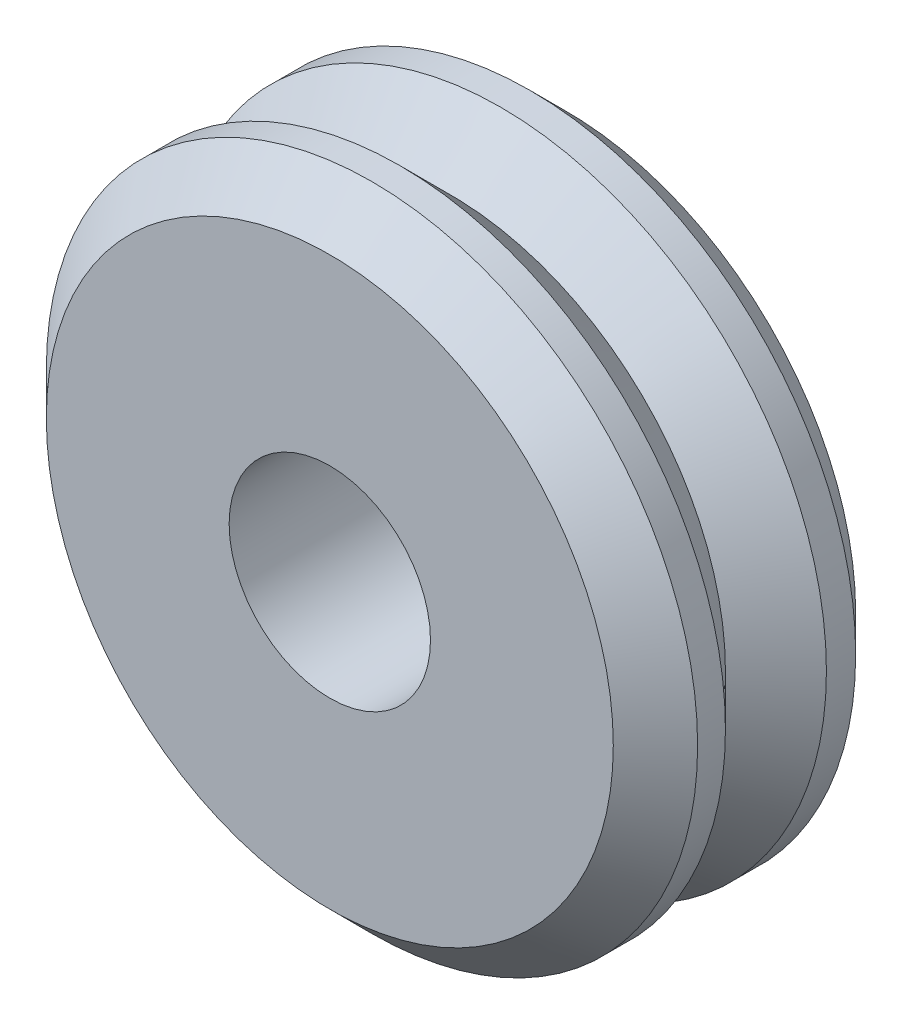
ISO-10303-21;
HEADER;
FILE_DESCRIPTION(('STEP AP214'),'2;1');
FILE_NAME('part.step','',(''),(''),'','','');
FILE_SCHEMA(('AUTOMOTIVE_DESIGN { 1 0 10303 214 1 1 1 1 }'));
ENDSEC;
DATA;
#1=APPLICATION_CONTEXT('core data for automotive mechanical design processes');
#2=APPLICATION_PROTOCOL_DEFINITION('international standard','automotive_design',2000,#1);
#3=PRODUCT_CONTEXT('',#1,'mechanical');
#4=PRODUCT('Part','Part','',(#3));
#5=PRODUCT_RELATED_PRODUCT_CATEGORY('part','',(#4));
#6=PRODUCT_DEFINITION_FORMATION('','',#4);
#7=PRODUCT_DEFINITION_CONTEXT('part definition',#1,'design');
#8=PRODUCT_DEFINITION('design','',#6,#7);
#9=PRODUCT_DEFINITION_SHAPE('','',#8);
#10=(LENGTH_UNIT() NAMED_UNIT(*) SI_UNIT(.MILLI.,.METRE.));
#11=(NAMED_UNIT(*) PLANE_ANGLE_UNIT() SI_UNIT($,.RADIAN.));
#12=(NAMED_UNIT(*) SI_UNIT($,.STERADIAN.) SOLID_ANGLE_UNIT());
#13=UNCERTAINTY_MEASURE_WITH_UNIT(LENGTH_MEASURE(1.E-05),#10,'distance_accuracy_value','');
#14=(GEOMETRIC_REPRESENTATION_CONTEXT(3) GLOBAL_UNCERTAINTY_ASSIGNED_CONTEXT((#13)) GLOBAL_UNIT_ASSIGNED_CONTEXT((#10,
#11,#12)) REPRESENTATION_CONTEXT('',''));
#15=CARTESIAN_POINT('',(0.,0.,0.));
#16=DIRECTION('',(0.,0.,1.));
#17=DIRECTION('',(1.,0.,0.));
#18=AXIS2_PLACEMENT_3D('',#15,#16,#17);
#19=CARTESIAN_POINT('',(0.,0.,11.13));
#20=DIRECTION('',(0.,0.,1.));
#21=DIRECTION('',(1.,0.,0.));
#22=AXIS2_PLACEMENT_3D('',#19,#20,#21);
#23=PLANE('',#22);
#24=CARTESIAN_POINT('',(0.,0.,11.13));
#25=DIRECTION('',(0.,0.,1.));
#26=DIRECTION('',(1.,0.,0.));
#27=AXIS2_PLACEMENT_3D('',#24,#25,#26);
#28=CIRCLE('',#27,4.75);
#29=CARTESIAN_POINT('',(-4.75,0.,11.13));
#30=VERTEX_POINT('',#29);
#31=EDGE_CURVE('E10',#30,#30,#28,.T.);
#32=ORIENTED_EDGE('',*,*,#31,.F.);
#33=EDGE_LOOP('',(#32));
#34=FACE_BOUND('',#33,.T.);
#35=CARTESIAN_POINT('',(0.,0.,11.13));
#36=DIRECTION('',(0.,0.,1.));
#37=DIRECTION('',(1.,0.,0.));
#38=AXIS2_PLACEMENT_3D('',#35,#36,#37);
#39=CIRCLE('',#38,13.3754975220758);
#40=CARTESIAN_POINT('',(13.3754975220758,0.,11.13));
#41=VERTEX_POINT('',#40);
#42=EDGE_CURVE('E54',#41,#41,#39,.T.);
#43=ORIENTED_EDGE('',*,*,#42,.T.);
#44=EDGE_LOOP('',(#43));
#45=FACE_BOUND('',#44,.T.);
#46=ADVANCED_FACE('F33',(#34,#45),#23,.T.);
#47=CARTESIAN_POINT('',(0.,0.,0.));
#48=DIRECTION('',(0.,0.,1.));
#49=DIRECTION('',(1.,0.,0.));
#50=AXIS2_PLACEMENT_3D('',#47,#48,#49);
#51=PLANE('',#50);
#52=CARTESIAN_POINT('',(0.,0.,0.));
#53=DIRECTION('',(0.,0.,1.));
#54=DIRECTION('',(1.,0.,0.));
#55=AXIS2_PLACEMENT_3D('',#52,#53,#54);
#56=CIRCLE('',#55,4.75);
#57=CARTESIAN_POINT('',(-4.75,0.,0.));
#58=VERTEX_POINT('',#57);
#59=EDGE_CURVE('E41',#58,#58,#56,.T.);
#60=ORIENTED_EDGE('',*,*,#59,.T.);
#61=EDGE_LOOP('',(#60));
#62=FACE_BOUND('',#61,.T.);
#63=CARTESIAN_POINT('',(0.,0.,0.));
#64=DIRECTION('',(0.,0.,1.));
#65=DIRECTION('',(1.,0.,0.));
#66=AXIS2_PLACEMENT_3D('',#63,#64,#65);
#67=CIRCLE('',#66,13.6815626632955);
#68=CARTESIAN_POINT('',(13.6815626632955,0.,0.));
#69=VERTEX_POINT('',#68);
#70=EDGE_CURVE('E46',#69,#69,#67,.T.);
#71=ORIENTED_EDGE('',*,*,#70,.F.);
#72=EDGE_LOOP('',(#71));
#73=FACE_BOUND('',#72,.T.);
#74=ADVANCED_FACE('F70',(#62,#73),#51,.F.);
#75=CARTESIAN_POINT('',(0.,0.,11.13));
#76=DIRECTION('',(0.,0.,-1.));
#77=DIRECTION('',(-1.,0.,0.));
#78=AXIS2_PLACEMENT_3D('',#75,#76,#77);
#79=CYLINDRICAL_SURFACE('',#78,4.75);
#80=CARTESIAN_POINT('',(-4.75,0.,11.13));
#81=CARTESIAN_POINT('',(-4.75,0.,11.0140625));
#82=CARTESIAN_POINT('',(-4.75,0.,10.898125));
#83=CARTESIAN_POINT('',(-4.75,0.,10.66625));
#84=CARTESIAN_POINT('',(-4.75,0.,10.5503125));
#85=CARTESIAN_POINT('',(-4.75,0.,10.3184375));
#86=CARTESIAN_POINT('',(-4.75,0.,10.2025));
#87=CARTESIAN_POINT('',(-4.75,0.,9.970625));
#88=CARTESIAN_POINT('',(-4.75,0.,9.8546875));
#89=CARTESIAN_POINT('',(-4.75,0.,9.6228125));
#90=CARTESIAN_POINT('',(-4.75,0.,9.506875));
#91=CARTESIAN_POINT('',(-4.75,0.,9.275));
#92=CARTESIAN_POINT('',(-4.75,0.,9.1590625));
#93=CARTESIAN_POINT('',(-4.75,0.,8.9271875));
#94=CARTESIAN_POINT('',(-4.75,0.,8.81125));
#95=CARTESIAN_POINT('',(-4.75,0.,8.579375));
#96=CARTESIAN_POINT('',(-4.75,0.,8.4634375));
#97=CARTESIAN_POINT('',(-4.75,0.,8.2315625));
#98=CARTESIAN_POINT('',(-4.75,0.,8.115625));
#99=CARTESIAN_POINT('',(-4.75,0.,7.88375));
#100=CARTESIAN_POINT('',(-4.75,0.,7.7678125));
#101=CARTESIAN_POINT('',(-4.75,0.,7.5359375));
#102=CARTESIAN_POINT('',(-4.75,0.,7.42));
#103=CARTESIAN_POINT('',(-4.75,0.,7.188125));
#104=CARTESIAN_POINT('',(-4.75,0.,7.0721875));
#105=CARTESIAN_POINT('',(-4.75,0.,6.8403125));
#106=CARTESIAN_POINT('',(-4.75,0.,6.724375));
#107=CARTESIAN_POINT('',(-4.75,0.,6.4925));
#108=CARTESIAN_POINT('',(-4.75,0.,6.3765625));
#109=CARTESIAN_POINT('',(-4.75,0.,6.1446875));
#110=CARTESIAN_POINT('',(-4.75,0.,6.02875));
#111=CARTESIAN_POINT('',(-4.75,0.,5.796875));
#112=CARTESIAN_POINT('',(-4.75,0.,5.6809375));
#113=CARTESIAN_POINT('',(-4.75,0.,5.4490625));
#114=CARTESIAN_POINT('',(-4.75,0.,5.333125));
#115=CARTESIAN_POINT('',(-4.75,0.,5.10125));
#116=CARTESIAN_POINT('',(-4.75,0.,4.9853125));
#117=CARTESIAN_POINT('',(-4.75,0.,4.7534375));
#118=CARTESIAN_POINT('',(-4.75,0.,4.6375));
#119=CARTESIAN_POINT('',(-4.75,0.,4.405625));
#120=CARTESIAN_POINT('',(-4.75,0.,4.2896875));
#121=CARTESIAN_POINT('',(-4.75,0.,4.0578125));
#122=CARTESIAN_POINT('',(-4.75,0.,3.941875));
#123=CARTESIAN_POINT('',(-4.75,0.,3.71));
#124=CARTESIAN_POINT('',(-4.75,0.,3.5940625));
#125=CARTESIAN_POINT('',(-4.75,0.,3.3621875));
#126=CARTESIAN_POINT('',(-4.75,0.,3.24625));
#127=CARTESIAN_POINT('',(-4.75,0.,3.014375));
#128=CARTESIAN_POINT('',(-4.75,0.,2.8984375));
#129=CARTESIAN_POINT('',(-4.75,0.,2.6665625));
#130=CARTESIAN_POINT('',(-4.75,0.,2.550625));
#131=CARTESIAN_POINT('',(-4.75,0.,2.31875));
#132=CARTESIAN_POINT('',(-4.75,0.,2.2028125));
#133=CARTESIAN_POINT('',(-4.75,0.,1.9709375));
#134=CARTESIAN_POINT('',(-4.75,0.,1.855));
#135=CARTESIAN_POINT('',(-4.75,0.,1.623125));
#136=CARTESIAN_POINT('',(-4.75,0.,1.5071875));
#137=CARTESIAN_POINT('',(-4.75,0.,1.2753125));
#138=CARTESIAN_POINT('',(-4.75,0.,1.159375));
#139=CARTESIAN_POINT('',(-4.75,0.,0.927499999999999));
#140=CARTESIAN_POINT('',(-4.75,0.,0.811562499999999));
#141=CARTESIAN_POINT('',(-4.75,0.,0.579687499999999));
#142=CARTESIAN_POINT('',(-4.75,0.,0.463749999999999));
#143=CARTESIAN_POINT('',(-4.75,0.,0.231874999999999));
#144=CARTESIAN_POINT('',(-4.75,0.,0.115937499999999));
#145=CARTESIAN_POINT('',(-4.75,0.,0.));
#146=B_SPLINE_CURVE_WITH_KNOTS('',3,(#80,#81,#82,#83,#84,#85,#86,#87,#88,#89,#90,#91,#92,#93,
#94,#95,#96,#97,#98,#99,#100,#101,#102,#103,#104,#105,#106,#107,#108,#109,#110,#111,#112,#113,
#114,#115,#116,#117,#118,#119,#120,#121,#122,#123,#124,#125,#126,#127,#128,#129,#130,#131,#132,
#133,#134,#135,#136,#137,#138,#139,#140,#141,#142,#143,#144,#145),.UNSPECIFIED.,.F.,.F.,(4,2,2,
2,2,2,2,2,2,2,2,2,2,2,2,2,2,2,2,2,2,2,2,2,2,2,2,2,2,2,2,2,4),(0.,0.347812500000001,
0.695625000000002,1.0434375,1.39125,1.7390625,2.086875,2.4346875,2.7825,3.1303125,3.478125,
3.8259375,4.17375,4.5215625,4.869375,5.2171875,5.565,5.9128125,6.260625,6.6084375,6.95625,
7.3040625,7.651875,7.9996875,8.3475,8.6953125,9.043125,9.3909375,9.73875,10.0865625,10.434375,
10.7821875,11.13),.UNSPECIFIED.);
#147=EDGE_CURVE('BSEAM72',#30,#58,#146,.T.);
#148=ORIENTED_EDGE('',*,*,#31,.T.);
#149=ORIENTED_EDGE('',*,*,#59,.F.);
#150=ORIENTED_EDGE('',*,*,#147,.T.);
#151=ORIENTED_EDGE('',*,*,#147,.F.);
#152=EDGE_LOOP('',(#148,#150,#149,#151));
#153=FACE_BOUND('',#152,.T.);
#154=ADVANCED_FACE('F72',(#153),#79,.F.);
#155=CARTESIAN_POINT('',(0.,0.,11.5228129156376));
#156=DIRECTION('',(0.,0.,-1.));
#157=DIRECTION('',(-1.,0.,0.));
#158=AXIS2_PLACEMENT_3D('',#155,#156,#157);
#159=CONICAL_SURFACE('',#158,12.9826846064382,0.785398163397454);
#160=ORIENTED_EDGE('',*,*,#42,.F.);
#161=EDGE_LOOP('',(#160));
#162=FACE_BOUND('',#161,.T.);
#163=CARTESIAN_POINT('',(0.,0.,9.14049752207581));
#164=DIRECTION('',(0.,0.,-1.));
#165=DIRECTION('',(-1.,0.,0.));
#166=AXIS2_PLACEMENT_3D('',#163,#164,#165);
#167=CIRCLE('',#166,15.365);
#168=CARTESIAN_POINT('',(-15.365,0.,9.14049752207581));
#169=VERTEX_POINT('',#168);
#170=EDGE_CURVE('E51',#169,#169,#167,.F.);
#171=ORIENTED_EDGE('',*,*,#170,.T.);
#172=EDGE_LOOP('',(#171));
#173=FACE_BOUND('',#172,.T.);
#174=ADVANCED_FACE('F78',(#162,#173),#159,.T.);
#175=CARTESIAN_POINT('',(0.,0.,2.37353870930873));
#176=DIRECTION('',(0.,0.,1.));
#177=DIRECTION('',(1.,0.,0.));
#178=AXIS2_PLACEMENT_3D('',#175,#176,#177);
#179=CONICAL_SURFACE('',#178,16.0551013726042,0.785398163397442);
#180=CARTESIAN_POINT('',(0.,0.,1.68343733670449));
#181=DIRECTION('',(0.,0.,1.));
#182=DIRECTION('',(1.,0.,0.));
#183=AXIS2_PLACEMENT_3D('',#180,#181,#182);
#184=CIRCLE('',#183,15.365);
#185=CARTESIAN_POINT('',(-15.365,0.,1.68343733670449));
#186=VERTEX_POINT('',#185);
#187=EDGE_CURVE('E37',#186,#186,#184,.F.);
#188=ORIENTED_EDGE('',*,*,#187,.T.);
#189=EDGE_LOOP('',(#188));
#190=FACE_BOUND('',#189,.T.);
#191=ORIENTED_EDGE('',*,*,#70,.T.);
#192=EDGE_LOOP('',(#191));
#193=FACE_BOUND('',#192,.T.);
#194=ADVANCED_FACE('F68',(#190,#193),#179,.T.);
#195=CARTESIAN_POINT('',(0.,0.,11.13));
#196=DIRECTION('',(0.,0.,-1.));
#197=DIRECTION('',(-1.,0.,0.));
#198=AXIS2_PLACEMENT_3D('',#195,#196,#197);
#199=CYLINDRICAL_SURFACE('',#198,15.365);
#200=CARTESIAN_POINT('',(0.,0.,7.82827086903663));
#201=DIRECTION('',(0.,0.,1.));
#202=DIRECTION('',(1.,0.,0.));
#203=AXIS2_PLACEMENT_3D('',#200,#201,#202);
#204=CIRCLE('',#203,15.365);
#205=CARTESIAN_POINT('',(-15.365,0.,7.82827086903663));
#206=VERTEX_POINT('',#205);
#207=EDGE_CURVE('E56',#206,#206,#204,.F.);
#208=CARTESIAN_POINT('',(-15.365,0.,9.14049752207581));
#209=CARTESIAN_POINT('',(-15.365,0.,9.12682849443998));
#210=CARTESIAN_POINT('',(-15.365,0.,9.11315946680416));
#211=CARTESIAN_POINT('',(-15.365,0.,9.08582141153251));
#212=CARTESIAN_POINT('',(-15.365,0.,9.07215238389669));
#213=CARTESIAN_POINT('',(-15.365,0.,9.04481432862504));
#214=CARTESIAN_POINT('',(-15.365,0.,9.03114530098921));
#215=CARTESIAN_POINT('',(-15.365,0.,9.00380724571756));
#216=CARTESIAN_POINT('',(-15.365,0.,8.99013821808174));
#217=CARTESIAN_POINT('',(-15.365,0.,8.96280016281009));
#218=CARTESIAN_POINT('',(-15.365,0.,8.94913113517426));
#219=CARTESIAN_POINT('',(-15.365,0.,8.92179307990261));
#220=CARTESIAN_POINT('',(-15.365,0.,8.90812405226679));
#221=CARTESIAN_POINT('',(-15.365,0.,8.88078599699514));
#222=CARTESIAN_POINT('',(-15.365,0.,8.86711696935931));
#223=CARTESIAN_POINT('',(-15.365,0.,8.83977891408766));
#224=CARTESIAN_POINT('',(-15.365,0.,8.82610988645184));
#225=CARTESIAN_POINT('',(-15.365,0.,8.79877183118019));
#226=CARTESIAN_POINT('',(-15.365,0.,8.78510280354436));
#227=CARTESIAN_POINT('',(-15.365,0.,8.75776474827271));
#228=CARTESIAN_POINT('',(-15.365,0.,8.74409572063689));
#229=CARTESIAN_POINT('',(-15.365,0.,8.71675766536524));
#230=CARTESIAN_POINT('',(-15.365,0.,8.70308863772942));
#231=CARTESIAN_POINT('',(-15.365,0.,8.67575058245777));
#232=CARTESIAN_POINT('',(-15.365,0.,8.66208155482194));
#233=CARTESIAN_POINT('',(-15.365,0.,8.63474349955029));
#234=CARTESIAN_POINT('',(-15.365,0.,8.62107447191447));
#235=CARTESIAN_POINT('',(-15.365,0.,8.59373641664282));
#236=CARTESIAN_POINT('',(-15.365,0.,8.58006738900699));
#237=CARTESIAN_POINT('',(-15.365,0.,8.55272933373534));
#238=CARTESIAN_POINT('',(-15.365,0.,8.53906030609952));
#239=CARTESIAN_POINT('',(-15.365,0.,8.51172225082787));
#240=CARTESIAN_POINT('',(-15.365,0.,8.49805322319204));
#241=CARTESIAN_POINT('',(-15.365,0.,8.47071516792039));
#242=CARTESIAN_POINT('',(-15.365,0.,8.45704614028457));
#243=CARTESIAN_POINT('',(-15.365,0.,8.42970808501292));
#244=CARTESIAN_POINT('',(-15.365,0.,8.41603905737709));
#245=CARTESIAN_POINT('',(-15.365,0.,8.38870100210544));
#246=CARTESIAN_POINT('',(-15.365,0.,8.37503197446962));
#247=CARTESIAN_POINT('',(-15.365,0.,8.34769391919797));
#248=CARTESIAN_POINT('',(-15.365,0.,8.33402489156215));
#249=CARTESIAN_POINT('',(-15.365,0.,8.3066868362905));
#250=CARTESIAN_POINT('',(-15.365,0.,8.29301780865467));
#251=CARTESIAN_POINT('',(-15.365,0.,8.26567975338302));
#252=CARTESIAN_POINT('',(-15.365,0.,8.2520107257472));
#253=CARTESIAN_POINT('',(-15.365,0.,8.22467267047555));
#254=CARTESIAN_POINT('',(-15.365,0.,8.21100364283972));
#255=CARTESIAN_POINT('',(-15.365,0.,8.18366558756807));
#256=CARTESIAN_POINT('',(-15.365,0.,8.16999655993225));
#257=CARTESIAN_POINT('',(-15.365,0.,8.1426585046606));
#258=CARTESIAN_POINT('',(-15.365,0.,8.12898947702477));
#259=CARTESIAN_POINT('',(-15.365,0.,8.10165142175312));
#260=CARTESIAN_POINT('',(-15.365,0.,8.0879823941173));
#261=CARTESIAN_POINT('',(-15.365,0.,8.06064433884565));
#262=CARTESIAN_POINT('',(-15.365,0.,8.04697531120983));
#263=CARTESIAN_POINT('',(-15.365,0.,8.01963725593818));
#264=CARTESIAN_POINT('',(-15.365,0.,8.00596822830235));
#265=CARTESIAN_POINT('',(-15.365,0.,7.9786301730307));
#266=CARTESIAN_POINT('',(-15.365,0.,7.96496114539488));
#267=CARTESIAN_POINT('',(-15.365,0.,7.93762309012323));
#268=CARTESIAN_POINT('',(-15.365,0.,7.9239540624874));
#269=CARTESIAN_POINT('',(-15.365,0.,7.89661600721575));
#270=CARTESIAN_POINT('',(-15.365,0.,7.88294697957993));
#271=CARTESIAN_POINT('',(-15.365,0.,7.85560892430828));
#272=CARTESIAN_POINT('',(-15.365,0.,7.84193989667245));
#273=CARTESIAN_POINT('',(-15.365,0.,7.82827086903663));
#274=B_SPLINE_CURVE_WITH_KNOTS('',3,(#208,#209,#210,#211,#212,#213,#214,#215,#216,#217,#218,
#219,#220,#221,#222,#223,#224,#225,#226,#227,#228,#229,#230,#231,#232,#233,#234,#235,#236,#237,
#238,#239,#240,#241,#242,#243,#244,#245,#246,#247,#248,#249,#250,#251,#252,#253,#254,#255,#256,
#257,#258,#259,#260,#261,#262,#263,#264,#265,#266,#267,#268,#269,#270,#271,#272,#273),
.UNSPECIFIED.,.F.,.F.,(4,2,2,2,2,2,2,2,2,2,2,2,2,2,2,2,2,2,2,2,2,2,2,2,2,2,2,2,2,2,2,2,4),(0.,
0.0410070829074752,0.0820141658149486,0.123021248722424,0.164028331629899,0.205035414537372,
0.246042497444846,0.287049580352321,0.328056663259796,0.36906374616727,0.410070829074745,
0.451077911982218,0.492084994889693,0.533092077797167,0.574099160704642,0.615106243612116,
0.656113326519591,0.697120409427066,0.738127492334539,0.779134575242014,0.820141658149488,
0.861148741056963,0.902155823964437,0.943162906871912,0.984169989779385,1.02517707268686,
1.06618415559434,1.10719123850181,1.14819832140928,1.18920540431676,1.23021248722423,
1.27121957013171,1.31222665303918),.UNSPECIFIED.);
#275=EDGE_CURVE('BSEAM85',#169,#206,#274,.T.);
#276=ORIENTED_EDGE('',*,*,#170,.F.);
#277=ORIENTED_EDGE('',*,*,#207,.F.);
#278=ORIENTED_EDGE('',*,*,#275,.T.);
#279=ORIENTED_EDGE('',*,*,#275,.F.);
#280=EDGE_LOOP('',(#276,#278,#277,#279));
#281=FACE_BOUND('',#280,.T.);
#282=ADVANCED_FACE('F85',(#281),#199,.T.);
#283=CARTESIAN_POINT('',(0.,0.,8.48438419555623));
#284=DIRECTION('',(0.,0.,1.));
#285=DIRECTION('',(1.,0.,0.));
#286=AXIS2_PLACEMENT_3D('',#283,#284,#285);
#287=CONICAL_SURFACE('',#286,16.0211133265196,0.785398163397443);
#288=CARTESIAN_POINT('',(0.,0.,5.44595547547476));
#289=DIRECTION('',(0.,0.,1.));
#290=DIRECTION('',(1.,0.,0.));
#291=AXIS2_PLACEMENT_3D('',#288,#289,#290);
#292=CIRCLE('',#291,12.9826846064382);
#293=CARTESIAN_POINT('',(12.9826846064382,0.,5.44595547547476));
#294=VERTEX_POINT('',#293);
#295=EDGE_CURVE('E55',#294,#294,#292,.T.);
#296=ORIENTED_EDGE('',*,*,#295,.T.);
#297=EDGE_LOOP('',(#296));
#298=FACE_BOUND('',#297,.T.);
#299=ORIENTED_EDGE('',*,*,#207,.T.);
#300=EDGE_LOOP('',(#299));
#301=FACE_BOUND('',#300,.T.);
#302=ADVANCED_FACE('F89',(#298,#301),#287,.T.);
#303=CARTESIAN_POINT('',(0.,0.,5.44595547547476));
#304=DIRECTION('',(0.,0.,-1.));
#305=DIRECTION('',(-1.,0.,0.));
#306=AXIS2_PLACEMENT_3D('',#303,#304,#305);
#307=CONICAL_SURFACE('',#306,12.9826846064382,0.785398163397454);
#308=ORIENTED_EDGE('',*,*,#295,.F.);
#309=EDGE_LOOP('',(#308));
#310=FACE_BOUND('',#309,.T.);
#311=CARTESIAN_POINT('',(0.,0.,3.06364008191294));
#312=DIRECTION('',(0.,0.,-1.));
#313=DIRECTION('',(-1.,0.,0.));
#314=AXIS2_PLACEMENT_3D('',#311,#312,#313);
#315=CIRCLE('',#314,15.365);
#316=CARTESIAN_POINT('',(-15.365,0.,3.06364008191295));
#317=VERTEX_POINT('',#316);
#318=EDGE_CURVE('E58',#317,#317,#315,.F.);
#319=ORIENTED_EDGE('',*,*,#318,.T.);
#320=EDGE_LOOP('',(#319));
#321=FACE_BOUND('',#320,.T.);
#322=ADVANCED_FACE('F86',(#310,#321),#307,.T.);
#323=CARTESIAN_POINT('',(-15.365,0.,3.06364008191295));
#324=CARTESIAN_POINT('',(-15.365,0.,3.04926296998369));
#325=CARTESIAN_POINT('',(-15.365,0.,3.03488585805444));
#326=CARTESIAN_POINT('',(-15.365,0.,3.00613163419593));
#327=CARTESIAN_POINT('',(-15.365,0.,2.99175452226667));
#328=CARTESIAN_POINT('',(-15.365,0.,2.96300029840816));
#329=CARTESIAN_POINT('',(-15.365,0.,2.94862318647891));
#330=CARTESIAN_POINT('',(-15.365,0.,2.9198689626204));
#331=CARTESIAN_POINT('',(-15.365,0.,2.90549185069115));
#332=CARTESIAN_POINT('',(-15.365,0.,2.87673762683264));
#333=CARTESIAN_POINT('',(-15.365,0.,2.86236051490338));
#334=CARTESIAN_POINT('',(-15.365,0.,2.83360629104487));
#335=CARTESIAN_POINT('',(-15.365,0.,2.81922917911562));
#336=CARTESIAN_POINT('',(-15.365,0.,2.79047495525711));
#337=CARTESIAN_POINT('',(-15.365,0.,2.77609784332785));
#338=CARTESIAN_POINT('',(-15.365,0.,2.74734361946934));
#339=CARTESIAN_POINT('',(-15.365,0.,2.73296650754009));
#340=CARTESIAN_POINT('',(-15.365,0.,2.70421228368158));
#341=CARTESIAN_POINT('',(-15.365,0.,2.68983517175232));
#342=CARTESIAN_POINT('',(-15.365,0.,2.66108094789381));
#343=CARTESIAN_POINT('',(-15.365,0.,2.64670383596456));
#344=CARTESIAN_POINT('',(-15.365,0.,2.61794961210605));
#345=CARTESIAN_POINT('',(-15.365,0.,2.6035725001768));
#346=CARTESIAN_POINT('',(-15.365,0.,2.57481827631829));
#347=CARTESIAN_POINT('',(-15.365,0.,2.56044116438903));
#348=CARTESIAN_POINT('',(-15.365,0.,2.53168694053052));
#349=CARTESIAN_POINT('',(-15.365,0.,2.51730982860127));
#350=CARTESIAN_POINT('',(-15.365,0.,2.48855560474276));
#351=CARTESIAN_POINT('',(-15.365,0.,2.4741784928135));
#352=CARTESIAN_POINT('',(-15.365,0.,2.44542426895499));
#353=CARTESIAN_POINT('',(-15.365,0.,2.43104715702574));
#354=CARTESIAN_POINT('',(-15.365,0.,2.40229293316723));
#355=CARTESIAN_POINT('',(-15.365,0.,2.38791582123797));
#356=CARTESIAN_POINT('',(-15.365,0.,2.35916159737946));
#357=CARTESIAN_POINT('',(-15.365,0.,2.34478448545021));
#358=CARTESIAN_POINT('',(-15.365,0.,2.3160302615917));
#359=CARTESIAN_POINT('',(-15.365,0.,2.30165314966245));
#360=CARTESIAN_POINT('',(-15.365,0.,2.27289892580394));
#361=CARTESIAN_POINT('',(-15.365,0.,2.25852181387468));
#362=CARTESIAN_POINT('',(-15.365,0.,2.22976759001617));
#363=CARTESIAN_POINT('',(-15.365,0.,2.21539047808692));
#364=CARTESIAN_POINT('',(-15.365,0.,2.18663625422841));
#365=CARTESIAN_POINT('',(-15.365,0.,2.17225914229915));
#366=CARTESIAN_POINT('',(-15.365,0.,2.14350491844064));
#367=CARTESIAN_POINT('',(-15.365,0.,2.12912780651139));
#368=CARTESIAN_POINT('',(-15.365,0.,2.10037358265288));
#369=CARTESIAN_POINT('',(-15.365,0.,2.08599647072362));
#370=CARTESIAN_POINT('',(-15.365,0.,2.05724224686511));
#371=CARTESIAN_POINT('',(-15.365,0.,2.04286513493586));
#372=CARTESIAN_POINT('',(-15.365,0.,2.01411091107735));
#373=CARTESIAN_POINT('',(-15.365,0.,1.9997337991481));
#374=CARTESIAN_POINT('',(-15.365,0.,1.97097957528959));
#375=CARTESIAN_POINT('',(-15.365,0.,1.95660246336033));
#376=CARTESIAN_POINT('',(-15.365,0.,1.92784823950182));
#377=CARTESIAN_POINT('',(-15.365,0.,1.91347112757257));
#378=CARTESIAN_POINT('',(-15.365,0.,1.88471690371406));
#379=CARTESIAN_POINT('',(-15.365,0.,1.8703397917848));
#380=CARTESIAN_POINT('',(-15.365,0.,1.84158556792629));
#381=CARTESIAN_POINT('',(-15.365,0.,1.82720845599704));
#382=CARTESIAN_POINT('',(-15.365,0.,1.79845423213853));
#383=CARTESIAN_POINT('',(-15.365,0.,1.78407712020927));
#384=CARTESIAN_POINT('',(-15.365,0.,1.75532289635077));
#385=CARTESIAN_POINT('',(-15.365,0.,1.74094578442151));
#386=CARTESIAN_POINT('',(-15.365,0.,1.712191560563));
#387=CARTESIAN_POINT('',(-15.365,0.,1.69781444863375));
#388=CARTESIAN_POINT('',(-15.365,0.,1.68343733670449));
#389=B_SPLINE_CURVE_WITH_KNOTS('',3,(#323,#324,#325,#326,#327,#328,#329,#330,#331,#332,#333,
#334,#335,#336,#337,#338,#339,#340,#341,#342,#343,#344,#345,#346,#347,#348,#349,#350,#351,#352,
#353,#354,#355,#356,#357,#358,#359,#360,#361,#362,#363,#364,#365,#366,#367,#368,#369,#370,#371,
#372,#373,#374,#375,#376,#377,#378,#379,#380,#381,#382,#383,#384,#385,#386,#387,#388),
.UNSPECIFIED.,.F.,.F.,(4,2,2,2,2,2,2,2,2,2,2,2,2,2,2,2,2,2,2,2,2,2,2,2,2,2,2,2,2,2,2,2,4),(0.,
0.043131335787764,0.086262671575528,0.129394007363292,0.172525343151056,0.215656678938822,
0.258788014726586,0.30191935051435,0.345050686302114,0.388182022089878,0.431313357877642,
0.474444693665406,0.517576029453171,0.560707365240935,0.603838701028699,0.646970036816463,
0.690101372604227,0.733232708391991,0.776364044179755,0.819495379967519,0.862626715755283,
0.905758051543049,0.948889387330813,0.992020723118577,1.03515205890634,1.0782833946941,
1.12141473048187,1.16454606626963,1.2076774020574,1.25080873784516,1.29394007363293,
1.33707140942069,1.38020274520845),.UNSPECIFIED.);
#390=EDGE_CURVE('BSEAM35',#317,#186,#389,.T.);
#391=ORIENTED_EDGE('',*,*,#318,.F.);
#392=ORIENTED_EDGE('',*,*,#187,.F.);
#393=ORIENTED_EDGE('',*,*,#390,.T.);
#394=ORIENTED_EDGE('',*,*,#390,.F.);
#395=EDGE_LOOP('',(#391,#393,#392,#394));
#396=FACE_BOUND('',#395,.T.);
#397=ADVANCED_FACE('F35',(#396),#199,.T.);
#398=CLOSED_SHELL('',(#46,#74,#154,#174,#194,#282,#302,#322,#397));
#399=MANIFOLD_SOLID_BREP('B2',#398);
#400=ADVANCED_BREP_SHAPE_REPRESENTATION('',(#18,#399),#14);
#401=SHAPE_DEFINITION_REPRESENTATION(#9,#400);
ENDSEC;
END-ISO-10303-21;
